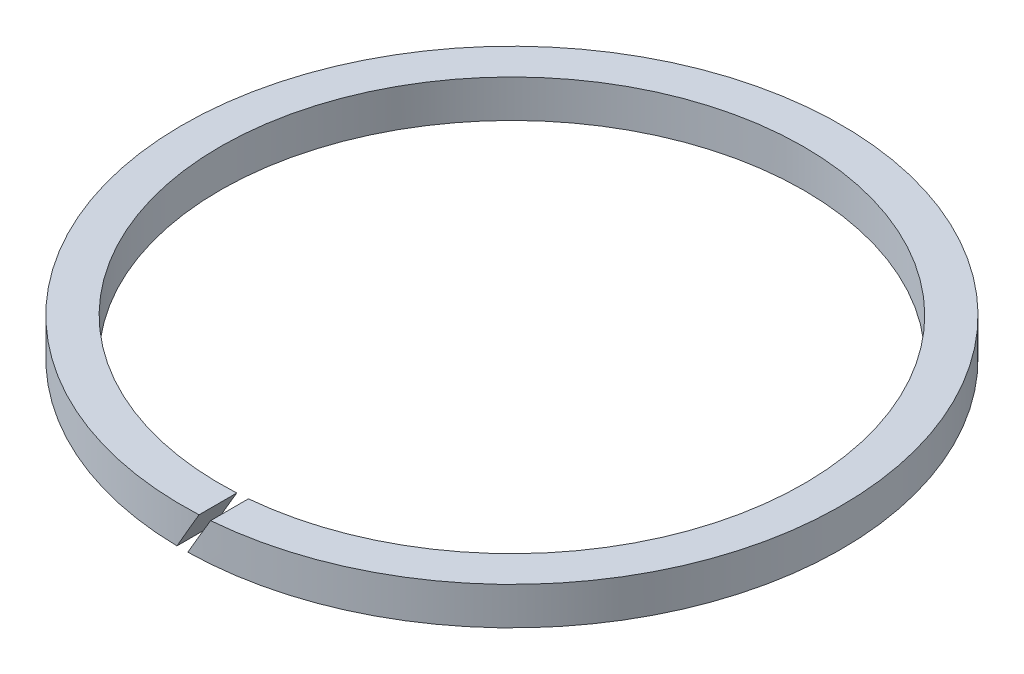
ISO-10303-21;
HEADER;
FILE_DESCRIPTION(('STEP AP214'),'2;1');
FILE_NAME('part.step','',(''),(''),'','','');
FILE_SCHEMA(('AUTOMOTIVE_DESIGN { 1 0 10303 214 1 1 1 1 }'));
ENDSEC;
DATA;
#1=APPLICATION_CONTEXT('core data for automotive mechanical design processes');
#2=APPLICATION_PROTOCOL_DEFINITION('international standard','automotive_design',2000,#1);
#3=PRODUCT_CONTEXT('',#1,'mechanical');
#4=PRODUCT('Part','Part','',(#3));
#5=PRODUCT_RELATED_PRODUCT_CATEGORY('part','',(#4));
#6=PRODUCT_DEFINITION_FORMATION('','',#4);
#7=PRODUCT_DEFINITION_CONTEXT('part definition',#1,'design');
#8=PRODUCT_DEFINITION('design','',#6,#7);
#9=PRODUCT_DEFINITION_SHAPE('','',#8);
#10=(LENGTH_UNIT() NAMED_UNIT(*) SI_UNIT(.MILLI.,.METRE.));
#11=(NAMED_UNIT(*) PLANE_ANGLE_UNIT() SI_UNIT($,.RADIAN.));
#12=(NAMED_UNIT(*) SI_UNIT($,.STERADIAN.) SOLID_ANGLE_UNIT());
#13=UNCERTAINTY_MEASURE_WITH_UNIT(LENGTH_MEASURE(1.E-05),#10,'distance_accuracy_value','');
#14=(GEOMETRIC_REPRESENTATION_CONTEXT(3) GLOBAL_UNCERTAINTY_ASSIGNED_CONTEXT((#13)) GLOBAL_UNIT_ASSIGNED_CONTEXT((#10,
#11,#12)) REPRESENTATION_CONTEXT('',''));
#15=CARTESIAN_POINT('',(0.,0.,0.));
#16=DIRECTION('',(0.,0.,1.));
#17=DIRECTION('',(1.,0.,0.));
#18=AXIS2_PLACEMENT_3D('',#15,#16,#17);
#19=CARTESIAN_POINT('',(0.,50.0339682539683,0.));
#20=DIRECTION('',(0.,1.,0.));
#21=DIRECTION('',(0.,0.,1.));
#22=AXIS2_PLACEMENT_3D('',#19,#20,#21);
#23=CYLINDRICAL_SURFACE('',#22,15.5);
#24=CARTESIAN_POINT('',(0.,0.500000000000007,0.));
#25=DIRECTION('',(0.86602540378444,-0.499999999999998,0.));
#26=DIRECTION('',(0.499999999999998,0.86602540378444,0.));
#27=AXIS2_PLACEMENT_3D('',#24,#25,#26);
#28=ELLIPSE('',#27,31.0000000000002,15.5);
#29=CARTESIAN_POINT('',(-0.288675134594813,0.,15.4973115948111));
#30=VERTEX_POINT('',#29);
#31=CARTESIAN_POINT('',(0.866025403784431,1.99999999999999,15.4757875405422));
#32=VERTEX_POINT('',#31);
#33=EDGE_CURVE('E86',#30,#32,#28,.F.);
#34=ORIENTED_EDGE('',*,*,#33,.F.);
#35=CARTESIAN_POINT('',(0.,0.,0.));
#36=DIRECTION('',(0.,1.,0.));
#37=DIRECTION('',(0.,0.,1.));
#38=AXIS2_PLACEMENT_3D('',#35,#36,#37);
#39=CIRCLE('',#38,15.5);
#40=CARTESIAN_POINT('',(0.288675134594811,0.,15.4973115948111));
#41=VERTEX_POINT('',#40);
#42=EDGE_CURVE('E83',#41,#30,#39,.T.);
#43=ORIENTED_EDGE('',*,*,#42,.F.);
#44=CARTESIAN_POINT('',(0.,-0.5,0.));
#45=DIRECTION('',(-0.86602540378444,0.499999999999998,0.));
#46=DIRECTION('',(0.499999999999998,0.86602540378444,0.));
#47=AXIS2_PLACEMENT_3D('',#44,#45,#46);
#48=ELLIPSE('',#47,31.0000000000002,15.5);
#49=CARTESIAN_POINT('',(1.44337567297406,1.99999999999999,15.4326493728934));
#50=VERTEX_POINT('',#49);
#51=EDGE_CURVE('E42',#50,#41,#48,.F.);
#52=ORIENTED_EDGE('',*,*,#51,.F.);
#53=CARTESIAN_POINT('',(0.,1.99999999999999,0.));
#54=DIRECTION('',(0.,1.,0.));
#55=DIRECTION('',(0.,0.,1.));
#56=AXIS2_PLACEMENT_3D('',#53,#54,#55);
#57=CIRCLE('',#56,15.5);
#58=EDGE_CURVE('E72',#50,#32,#57,.T.);
#59=ORIENTED_EDGE('',*,*,#58,.T.);
#60=EDGE_LOOP('',(#34,#43,#52,#59));
#61=FACE_BOUND('',#60,.T.);
#62=ADVANCED_FACE('F28',(#61),#23,.F.);
#63=CARTESIAN_POINT('',(15.5,2.,0.));
#64=DIRECTION('',(0.,-1.,0.));
#65=DIRECTION('',(0.,0.,-1.));
#66=AXIS2_PLACEMENT_3D('',#63,#64,#65);
#67=PLANE('',#66);
#68=DIRECTION('',(0.,0.,1.));
#69=VECTOR('',#68,1.);
#70=CARTESIAN_POINT('',(0.866025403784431,2.,0.));
#71=LINE('',#70,#69);
#72=CARTESIAN_POINT('',(0.866025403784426,1.99999999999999,17.4785582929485));
#73=VERTEX_POINT('',#72);
#74=EDGE_CURVE('E97',#32,#73,#71,.T.);
#75=ORIENTED_EDGE('',*,*,#74,.F.);
#76=ORIENTED_EDGE('',*,*,#58,.F.);
#77=DIRECTION('',(0.,0.,-1.));
#78=VECTOR('',#77,1.);
#79=CARTESIAN_POINT('',(1.44337567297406,2.,0.));
#80=LINE('',#79,#78);
#81=CARTESIAN_POINT('',(1.44337567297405,1.99999999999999,17.4403746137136));
#82=VERTEX_POINT('',#81);
#83=EDGE_CURVE('E80',#82,#50,#80,.T.);
#84=ORIENTED_EDGE('',*,*,#83,.F.);
#85=CARTESIAN_POINT('',(0.,1.99999999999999,0.));
#86=DIRECTION('',(0.,1.,0.));
#87=DIRECTION('',(0.,0.,1.));
#88=AXIS2_PLACEMENT_3D('',#85,#86,#87);
#89=CIRCLE('',#88,17.5);
#90=EDGE_CURVE('E79',#82,#73,#89,.T.);
#91=ORIENTED_EDGE('',*,*,#90,.T.);
#92=EDGE_LOOP('',(#75,#76,#84,#91));
#93=FACE_BOUND('',#92,.T.);
#94=ADVANCED_FACE('F96',(#93),#67,.F.);
#95=CARTESIAN_POINT('',(0.,50.0339682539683,0.));
#96=DIRECTION('',(0.,1.,0.));
#97=DIRECTION('',(0.,0.,1.));
#98=AXIS2_PLACEMENT_3D('',#95,#96,#97);
#99=CYLINDRICAL_SURFACE('',#98,17.5);
#100=CARTESIAN_POINT('',(0.,0.500000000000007,0.));
#101=DIRECTION('',(0.86602540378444,-0.499999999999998,0.));
#102=DIRECTION('',(0.499999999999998,0.86602540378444,0.));
#103=AXIS2_PLACEMENT_3D('',#100,#101,#102);
#104=ELLIPSE('',#103,35.0000000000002,17.5);
#105=CARTESIAN_POINT('',(-0.288675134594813,0.,17.4976188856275));
#106=VERTEX_POINT('',#105);
#107=EDGE_CURVE('E49',#73,#106,#104,.T.);
#108=ORIENTED_EDGE('',*,*,#107,.F.);
#109=ORIENTED_EDGE('',*,*,#90,.F.);
#110=CARTESIAN_POINT('',(0.,-0.5,0.));
#111=DIRECTION('',(-0.86602540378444,0.499999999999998,0.));
#112=DIRECTION('',(0.499999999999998,0.86602540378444,0.));
#113=AXIS2_PLACEMENT_3D('',#110,#111,#112);
#114=ELLIPSE('',#113,35.0000000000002,17.5);
#115=CARTESIAN_POINT('',(0.288675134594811,0.,17.4976188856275));
#116=VERTEX_POINT('',#115);
#117=EDGE_CURVE('E66',#116,#82,#114,.T.);
#118=ORIENTED_EDGE('',*,*,#117,.F.);
#119=CARTESIAN_POINT('',(0.,0.,0.));
#120=DIRECTION('',(0.,1.,0.));
#121=DIRECTION('',(0.,0.,1.));
#122=AXIS2_PLACEMENT_3D('',#119,#120,#121);
#123=CIRCLE('',#122,17.5);
#124=EDGE_CURVE('E77',#116,#106,#123,.T.);
#125=ORIENTED_EDGE('',*,*,#124,.T.);
#126=EDGE_LOOP('',(#108,#109,#118,#125));
#127=FACE_BOUND('',#126,.T.);
#128=ADVANCED_FACE('F76',(#127),#99,.T.);
#129=CARTESIAN_POINT('',(15.5,0.,0.));
#130=DIRECTION('',(0.,1.,0.));
#131=DIRECTION('',(0.,0.,1.));
#132=AXIS2_PLACEMENT_3D('',#129,#130,#131);
#133=PLANE('',#132);
#134=DIRECTION('',(0.,0.,-1.));
#135=VECTOR('',#134,1.);
#136=CARTESIAN_POINT('',(-0.288675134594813,0.,0.));
#137=LINE('',#136,#135);
#138=EDGE_CURVE('E11',#106,#30,#137,.T.);
#139=ORIENTED_EDGE('',*,*,#138,.F.);
#140=ORIENTED_EDGE('',*,*,#124,.F.);
#141=DIRECTION('',(0.,0.,1.));
#142=VECTOR('',#141,1.);
#143=CARTESIAN_POINT('',(0.288675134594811,0.,0.));
#144=LINE('',#143,#142);
#145=EDGE_CURVE('E35',#41,#116,#144,.T.);
#146=ORIENTED_EDGE('',*,*,#145,.F.);
#147=ORIENTED_EDGE('',*,*,#42,.T.);
#148=EDGE_LOOP('',(#139,#140,#146,#147));
#149=FACE_BOUND('',#148,.T.);
#150=ADVANCED_FACE('F82',(#149),#133,.F.);
#151=CARTESIAN_POINT('',(1.94434002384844,2.8676957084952,17.5));
#152=DIRECTION('',(-0.86602540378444,0.499999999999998,0.));
#153=DIRECTION('',(-0.499999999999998,-0.86602540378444,0.));
#154=AXIS2_PLACEMENT_3D('',#151,#152,#153);
#155=PLANE('',#154);
#156=ORIENTED_EDGE('',*,*,#51,.T.);
#157=ORIENTED_EDGE('',*,*,#145,.T.);
#158=ORIENTED_EDGE('',*,*,#117,.T.);
#159=ORIENTED_EDGE('',*,*,#83,.T.);
#160=EDGE_LOOP('',(#156,#157,#158,#159));
#161=FACE_BOUND('',#160,.T.);
#162=ADVANCED_FACE('F65',(#161),#155,.T.);
#163=CARTESIAN_POINT('',(1.36698975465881,2.8676957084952,17.5));
#164=DIRECTION('',(0.86602540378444,-0.499999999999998,0.));
#165=DIRECTION('',(0.499999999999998,0.86602540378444,0.));
#166=AXIS2_PLACEMENT_3D('',#163,#164,#165);
#167=PLANE('',#166);
#168=ORIENTED_EDGE('',*,*,#33,.T.);
#169=ORIENTED_EDGE('',*,*,#74,.T.);
#170=ORIENTED_EDGE('',*,*,#107,.T.);
#171=ORIENTED_EDGE('',*,*,#138,.T.);
#172=EDGE_LOOP('',(#168,#169,#170,#171));
#173=FACE_BOUND('',#172,.T.);
#174=ADVANCED_FACE('F102',(#173),#167,.T.);
#175=CLOSED_SHELL('',(#62,#94,#128,#150,#162,#174));
#176=MANIFOLD_SOLID_BREP('B2',#175);
#177=ADVANCED_BREP_SHAPE_REPRESENTATION('',(#18,#176),#14);
#178=SHAPE_DEFINITION_REPRESENTATION(#9,#177);
ENDSEC;
END-ISO-10303-21;
